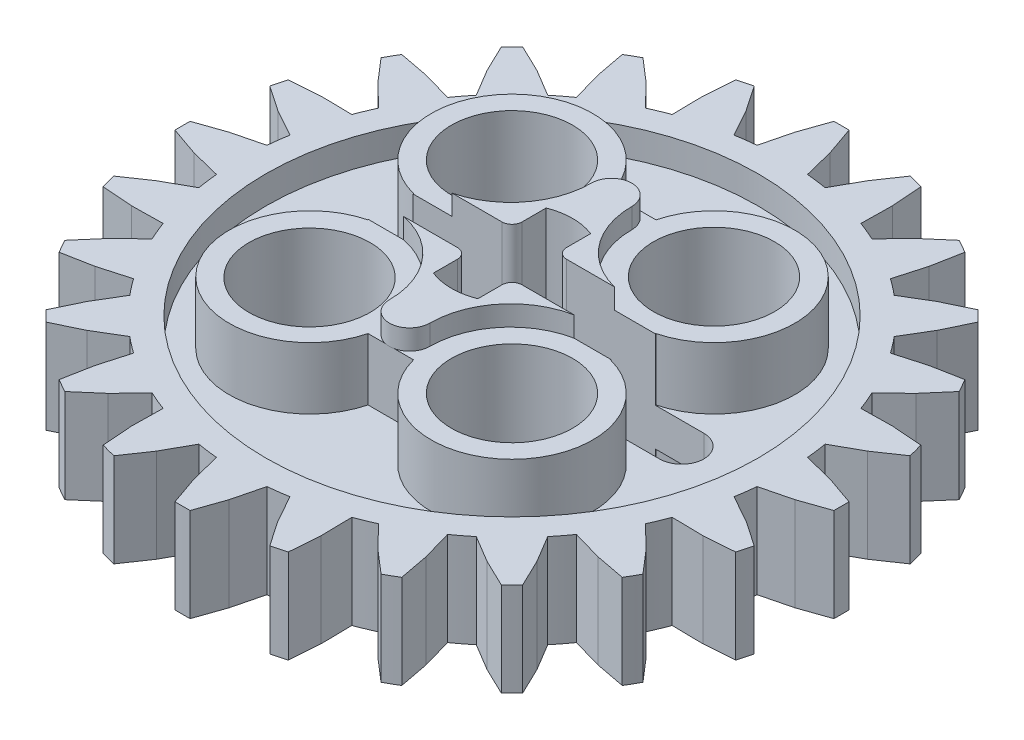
from build123d import *

# Parameters (mm, degrees)
EXTRUDE_1_DEPTH       = 3.71
SKETCH_2_R            = 9.75
CUT_EXTRUDE_1_DEPTH   = 1.105
EXTRUDE_2_DEPTH       = 2.45
CUT_EXTRUDE_START     = -1.105
SKETCH_4_R            = 9.75
CUT_EXTRUDE_2_DEPTH   = 1.105
EXTRUDE_START         = 2.45
EXTRUDE_3_DEPTH       = 2.45
EXTRUDE_4_DEPTH       = 0.8
EXTRUDE_START_2       = 0.8
EXTRUDE_5_DEPTH       = 0.8
EXTRUDE_6_DEPTH       = 2.45
EXTRUDE_7_DEPTH       = 2.45
EXTRUDE_8_DEPTH       = 0.8
EXTRUDE_9_DEPTH       = 0.8
CUT_EXTRUDE_3_DEPTH   = 21.11479555
CUT_EXTRUDE_4_DEPTH   = 21.11479555
HOLE_WIZARD_8_1_D     = 4.8
HOLE_WIZARD_8_1_DEPTH = 7.2
FILLET_1_R            = 0.4


with BuildPart() as part:
    # Sketch 1 → Extrude 1 (new body)
    with BuildSketch(Plane.XZ.offset(1.855)):
        with BuildLine():
            Line((6.783083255, -11.14864483), (6.556217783, -9.955702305))
            Line((6.556217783, -9.955702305), (6.217719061, -8.769405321))
            ThreePointArc((6.217719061, -8.769405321), (6.544185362, -8.528548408), (6.86133097, -8.275544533))
            Line((6.86133097, -8.275544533), (7.919595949, -8.909545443))
            Line((7.919595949, -8.909545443), (9.013172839, -9.437436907))
            ThreePointArc((9.013172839, -9.437436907), (9.227743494, -9.227743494), (9.437436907, -9.013172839))
            Line((9.437436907, -9.013172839), (8.909545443, -7.919595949))
            Line((8.909545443, -7.919595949), (8.275544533, -6.86133097))
            ThreePointArc((8.275544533, -6.86133097), (8.528548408, -6.544185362), (8.769405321, -6.217719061))
            Line((8.769405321, -6.217719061), (9.955702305, -6.556217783))
            Line((9.955702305, -6.556217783), (11.14864483, -6.783083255))
            ThreePointArc((11.14864483, -6.783083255), (11.301631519, -6.525), (11.44864483, -6.263468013))
            Line((11.44864483, -6.263468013), (10.655702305, -5.343782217))
            Line((10.655702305, -5.343782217), (9.769405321, -4.485668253))
            ThreePointArc((9.769405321, -4.485668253), (9.931704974, -4.113846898), (10.079859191, -3.73616631))
            Line((10.079859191, -3.73616631), (11.313344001, -3.756094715))
            Line((11.313344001, -3.756094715), (12.524355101, -3.666473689))
            ThreePointArc((12.524355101, -3.666473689), (12.605332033, -3.377588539), (12.679646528, -3.086918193))
            Line((12.679646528, -3.086918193), (11.675690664, -2.403798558))
            Line((11.675690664, -2.403798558), (10.597497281, -1.804314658))
            ThreePointArc((10.597497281, -1.804314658), (10.65803226, -1.403156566), (10.703387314, -1))
            Line((10.703387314, -1), (11.9, -0.7))
            Line((11.9, -0.7), (13.046551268, -0.3))
            ThreePointArc((13.046551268, -0.3), (13.05, 0), (13.046551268, 0.3))
            Line((13.046551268, 0.3), (11.9, 0.7))
            Line((11.9, 0.7), (10.703387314, 1))
            ThreePointArc((10.703387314, 1), (10.65803226, 1.403156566), (10.597497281, 1.804314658))
            Line((10.597497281, 1.804314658), (11.675690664, 2.403798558))
            Line((11.675690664, 2.403798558), (12.679646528, 3.086918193))
            ThreePointArc((12.679646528, 3.086918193), (12.605332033, 3.377588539), (12.524355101, 3.666473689))
            Line((12.524355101, 3.666473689), (11.313344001, 3.756094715))
            Line((11.313344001, 3.756094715), (10.079859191, 3.73616631))
            ThreePointArc((10.079859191, 3.73616631), (9.931704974, 4.113846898), (9.769405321, 4.485668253))
            Line((9.769405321, 4.485668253), (10.655702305, 5.343782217))
            Line((10.655702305, 5.343782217), (11.44864483, 6.263468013))
            ThreePointArc((11.44864483, 6.263468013), (11.301631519, 6.525), (11.14864483, 6.783083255))
            Line((11.14864483, 6.783083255), (9.955702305, 6.556217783))
            Line((9.955702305, 6.556217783), (8.769405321, 6.217719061))
            ThreePointArc((8.769405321, 6.217719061), (8.528548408, 6.544185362), (8.275544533, 6.86133097))
            Line((8.275544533, 6.86133097), (8.909545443, 7.919595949))
            Line((8.909545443, 7.919595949), (9.437436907, 9.013172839))
            ThreePointArc((9.437436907, 9.013172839), (9.227743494, 9.227743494), (9.013172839, 9.437436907))
            Line((9.013172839, 9.437436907), (7.919595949, 8.909545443))
            Line((7.919595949, 8.909545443), (6.86133097, 8.275544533))
            ThreePointArc((6.86133097, 8.275544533), (6.544185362, 8.528548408), (6.217719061, 8.769405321))
            Line((6.217719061, 8.769405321), (6.556217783, 9.955702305))
            Line((6.556217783, 9.955702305), (6.783083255, 11.14864483))
            ThreePointArc((6.783083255, 11.14864483), (6.525, 11.301631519), (6.263468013, 11.44864483))
            Line((6.263468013, 11.44864483), (5.343782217, 10.655702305))
            Line((5.343782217, 10.655702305), (4.485668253, 9.769405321))
            ThreePointArc((4.485668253, 9.769405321), (4.113846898, 9.931704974), (3.73616631, 10.079859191))
            Line((3.73616631, 10.079859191), (3.756094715, 11.313344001))
            Line((3.756094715, 11.313344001), (3.666473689, 12.524355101))
            ThreePointArc((3.666473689, 12.524355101), (3.377588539, 12.605332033), (3.086918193, 12.679646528))
            Line((3.086918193, 12.679646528), (2.403798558, 11.675690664))
            Line((2.403798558, 11.675690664), (1.804314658, 10.597497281))
            ThreePointArc((1.804314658, 10.597497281), (1.403156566, 10.65803226), (1, 10.703387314))
            Line((1, 10.703387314), (0.7, 11.9))
            Line((0.7, 11.9), (0.3, 13.046551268))
            ThreePointArc((0.3, 13.046551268), (0, 13.05), (-0.3, 13.046551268))
            Line((-0.3, 13.046551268), (-0.7, 11.9))
            Line((-0.7, 11.9), (-1, 10.703387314))
            ThreePointArc((-1, 10.703387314), (-1.403156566, 10.65803226), (-1.804314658, 10.597497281))
            Line((-1.804314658, 10.597497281), (-2.403798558, 11.675690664))
            Line((-2.403798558, 11.675690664), (-3.086918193, 12.679646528))
            ThreePointArc((-3.086918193, 12.679646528), (-3.377588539, 12.605332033), (-3.666473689, 12.524355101))
            Line((-3.666473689, 12.524355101), (-3.756094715, 11.313344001))
            Line((-3.756094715, 11.313344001), (-3.73616631, 10.079859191))
            ThreePointArc((-3.73616631, 10.079859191), (-4.113846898, 9.931704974), (-4.485668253, 9.769405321))
            Line((-4.485668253, 9.769405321), (-5.343782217, 10.655702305))
            Line((-5.343782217, 10.655702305), (-6.263468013, 11.44864483))
            ThreePointArc((-6.263468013, 11.44864483), (-6.525, 11.301631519), (-6.783083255, 11.14864483))
            Line((-6.783083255, 11.14864483), (-6.556217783, 9.955702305))
            Line((-6.556217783, 9.955702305), (-6.217719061, 8.769405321))
            ThreePointArc((-6.217719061, 8.769405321), (-6.544185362, 8.528548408), (-6.86133097, 8.275544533))
            Line((-6.86133097, 8.275544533), (-7.919595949, 8.909545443))
            Line((-7.919595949, 8.909545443), (-9.013172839, 9.437436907))
            ThreePointArc((-9.013172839, 9.437436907), (-9.227743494, 9.227743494), (-9.437436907, 9.013172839))
            Line((-9.437436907, 9.013172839), (-8.909545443, 7.919595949))
            Line((-8.909545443, 7.919595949), (-8.275544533, 6.86133097))
            ThreePointArc((-8.275544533, 6.86133097), (-8.528548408, 6.544185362), (-8.769405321, 6.217719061))
            Line((-8.769405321, 6.217719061), (-9.955702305, 6.556217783))
            Line((-9.955702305, 6.556217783), (-11.14864483, 6.783083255))
            ThreePointArc((-11.14864483, 6.783083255), (-11.301631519, 6.525), (-11.44864483, 6.263468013))
            Line((-11.44864483, 6.263468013), (-10.655702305, 5.343782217))
            Line((-10.655702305, 5.343782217), (-9.769405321, 4.485668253))
            ThreePointArc((-9.769405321, 4.485668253), (-9.931704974, 4.113846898), (-10.079859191, 3.73616631))
            Line((-10.079859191, 3.73616631), (-11.313344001, 3.756094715))
            Line((-11.313344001, 3.756094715), (-12.524355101, 3.666473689))
            ThreePointArc((-12.524355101, 3.666473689), (-12.605332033, 3.377588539), (-12.679646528, 3.086918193))
            Line((-12.679646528, 3.086918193), (-11.675690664, 2.403798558))
            Line((-11.675690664, 2.403798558), (-10.597497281, 1.804314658))
            ThreePointArc((-10.597497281, 1.804314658), (-10.65803226, 1.403156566), (-10.703387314, 1))
            Line((-10.703387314, 1), (-11.9, 0.7))
            Line((-11.9, 0.7), (-13.046551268, 0.3))
            ThreePointArc((-13.046551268, 0.3), (-13.05, 0), (-13.046551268, -0.3))
            Line((-13.046551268, -0.3), (-11.9, -0.7))
            Line((-11.9, -0.7), (-10.703387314, -1))
            ThreePointArc((-10.703387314, -1), (-10.65803226, -1.403156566), (-10.597497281, -1.804314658))
            Line((-10.597497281, -1.804314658), (-11.675690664, -2.403798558))
            Line((-11.675690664, -2.403798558), (-12.679646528, -3.086918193))
            ThreePointArc((-12.679646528, -3.086918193), (-12.605332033, -3.377588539), (-12.524355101, -3.666473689))
            Line((-12.524355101, -3.666473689), (-11.313344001, -3.756094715))
            Line((-11.313344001, -3.756094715), (-10.079859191, -3.73616631))
            ThreePointArc((-10.079859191, -3.73616631), (-9.931704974, -4.113846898), (-9.769405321, -4.485668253))
            Line((-9.769405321, -4.485668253), (-10.655702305, -5.343782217))
            Line((-10.655702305, -5.343782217), (-11.44864483, -6.263468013))
            ThreePointArc((-11.44864483, -6.263468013), (-11.301631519, -6.525), (-11.14864483, -6.783083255))
            Line((-11.14864483, -6.783083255), (-9.955702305, -6.556217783))
            Line((-9.955702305, -6.556217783), (-8.769405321, -6.217719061))
            ThreePointArc((-8.769405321, -6.217719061), (-8.528548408, -6.544185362), (-8.275544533, -6.86133097))
            Line((-8.275544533, -6.86133097), (-8.909545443, -7.919595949))
            Line((-8.909545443, -7.919595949), (-9.437436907, -9.013172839))
            ThreePointArc((-9.437436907, -9.013172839), (-9.227743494, -9.227743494), (-9.013172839, -9.437436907))
            Line((-9.013172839, -9.437436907), (-7.919595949, -8.909545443))
            Line((-7.919595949, -8.909545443), (-6.86133097, -8.275544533))
            ThreePointArc((-6.86133097, -8.275544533), (-6.544185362, -8.528548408), (-6.217719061, -8.769405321))
            Line((-6.217719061, -8.769405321), (-6.556217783, -9.955702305))
            Line((-6.556217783, -9.955702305), (-6.783083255, -11.14864483))
            ThreePointArc((-6.783083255, -11.14864483), (-6.525, -11.301631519), (-6.263468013, -11.44864483))
            Line((-6.263468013, -11.44864483), (-5.343782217, -10.655702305))
            Line((-5.343782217, -10.655702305), (-4.485668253, -9.769405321))
            ThreePointArc((-4.485668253, -9.769405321), (-4.113846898, -9.931704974), (-3.73616631, -10.079859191))
            Line((-3.73616631, -10.079859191), (-3.756094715, -11.313344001))
            Line((-3.756094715, -11.313344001), (-3.666473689, -12.524355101))
            ThreePointArc((-3.666473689, -12.524355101), (-3.377588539, -12.605332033), (-3.086918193, -12.679646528))
            Line((-3.086918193, -12.679646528), (-2.403798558, -11.675690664))
            Line((-2.403798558, -11.675690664), (-1.804314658, -10.597497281))
            ThreePointArc((-1.804314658, -10.597497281), (-1.403156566, -10.65803226), (-1, -10.703387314))
            Line((-1, -10.703387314), (-0.7, -11.9))
            Line((-0.7, -11.9), (-0.3, -13.046551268))
            ThreePointArc((-0.3, -13.046551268), (0, -13.05), (0.3, -13.046551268))
            Line((0.3, -13.046551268), (0.7, -11.9))
            Line((0.7, -11.9), (1, -10.703387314))
            ThreePointArc((1, -10.703387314), (1.403156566, -10.65803226), (1.804314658, -10.597497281))
            Line((1.804314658, -10.597497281), (2.403798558, -11.675690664))
            Line((2.403798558, -11.675690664), (3.086918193, -12.679646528))
            ThreePointArc((3.086918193, -12.679646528), (3.377588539, -12.605332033), (3.666473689, -12.524355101))
            Line((3.666473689, -12.524355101), (3.756094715, -11.313344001))
            Line((3.756094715, -11.313344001), (3.73616631, -10.079859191))
            ThreePointArc((3.73616631, -10.079859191), (4.113846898, -9.931704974), (4.485668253, -9.769405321))
            Line((4.485668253, -9.769405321), (5.343782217, -10.655702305))
            Line((5.343782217, -10.655702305), (6.263468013, -11.44864483))
            ThreePointArc((6.263468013, -11.44864483), (6.525, -11.301631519), (6.783083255, -11.14864483))
        make_face()
        with BuildLine():
            Line((6.72, -0.88), (-6.72, -0.88))
            ThreePointArc((-6.72, -0.88), (-7.6, 0), (-6.72, 0.88))
            Line((-6.72, 0.88), (6.72, 0.88))
            ThreePointArc((6.72, 0.88), (7.6, 0), (6.72, -0.88))
        make_face(mode=Mode.SUBTRACT)
    extrude(amount=-EXTRUDE_1_DEPTH)

    # Sketch 2 → Cut-Extrude 1 (cut)
    with BuildSketch(Plane.XZ.offset(1.855)):
        with Locations(Location((0, 0, 0), (0, 0, 90))):
            Circle(SKETCH_2_R)
        with BuildLine():
            Line((6.72, -0.88), (-6.72, -0.88))
            ThreePointArc((-6.72, -0.88), (-7.6, 0), (-6.72, 0.88))
            Line((-6.72, 0.88), (6.72, 0.88))
            ThreePointArc((6.72, 0.88), (7.6, 0), (6.72, -0.88))
        make_face(mode=Mode.SUBTRACT)
    extrude(amount=-CUT_EXTRUDE_1_DEPTH, mode=Mode.SUBTRACT)

    # Sketch 3 → Extrude 2 (add)
    with BuildSketch(Plane.XZ.offset(0.75)):
        with BuildLine():
            Line((4.8, 0.88), (-4.8, 0.88))
            Line((-4.8, 0.88), (-4.8, 0.901613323))
            ThreePointArc((-4.8, 0.901613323), (-6.2627417, 6.2627417), (-0.901613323, 4.8))
            Line((-0.901613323, 4.8), (0.901613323, 4.8))
            ThreePointArc((0.901613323, 4.8), (6.2627417, 6.2627417), (4.8, 0.901613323))
            Line((4.8, 0.901613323), (4.8, 0.88))
        make_face()
    extrude(amount=EXTRUDE_2_DEPTH)

    # Sketch 4 → Cut-Extrude 2 (cut)
    with BuildSketch(Plane(origin=(0, 1.855, 0), x_dir=(-1, 0, 0), z_dir=(0, 1, 0)).offset(CUT_EXTRUDE_START)):
        with Locations(Location((0, 0, 0), (0, 0, 90))):
            Circle(SKETCH_4_R)
        with BuildLine():
            Line((6.72, -0.88), (-6.72, -0.88))
            ThreePointArc((-6.72, -0.88), (-7.6, 0), (-6.72, 0.88))
            Line((-6.72, 0.88), (6.72, 0.88))
            ThreePointArc((6.72, 0.88), (7.6, 0), (6.72, -0.88))
        make_face(mode=Mode.SUBTRACT)
    extrude(amount=CUT_EXTRUDE_2_DEPTH, mode=Mode.SUBTRACT)

    # Sketch 5 → Extrude 3 (add)
    with BuildSketch(Plane(origin=(0, 0.75, 0), x_dir=(-1, 0, 0), z_dir=(0, 1, 0)).offset(EXTRUDE_START)):
        with BuildLine():
            Line((-0.901613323, 4.8), (0.901613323, 4.8))
            ThreePointArc((0.901613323, 4.8), (6.2627417, 6.2627417), (4.8, 0.901613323))
            Line((4.8, 0.901613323), (4.8, 0.88))
            Line((4.8, 0.88), (-4.8, 0.88))
            Line((-4.8, 0.88), (-4.8, 0.901613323))
            ThreePointArc((-4.8, 0.901613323), (-6.2627417, 6.2627417), (-0.901613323, 4.8))
        make_face()
    extrude(amount=-EXTRUDE_3_DEPTH)

    # Sketch 6 → Extrude 4 (add)
    with BuildSketch(Plane.XZ.offset(3.2)):
        with BuildLine():
            Line((3.338733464, 0.88), (-3.412848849, 0.88))
            ThreePointArc((-3.412848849, 0.88), (-1.563450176, 1.988438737), (-0.837057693, 4.018528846))
            ThreePointArc((-0.837057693, 4.018528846), (-0.037057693, 4.818528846), (0.762942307, 4.018528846))
            ThreePointArc((0.762942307, 4.018528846), (1.48933479, 1.988438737), (3.338733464, 0.88))
        make_face()
    extrude(amount=EXTRUDE_4_DEPTH)

    # Sketch 7 → Extrude 5 (add)
    with BuildSketch(Plane(origin=(0, 3.2, 0), x_dir=(-1, 0, 0), z_dir=(0, 1, 0)).offset(EXTRUDE_START_2)):
        with BuildLine():
            Line((3.412848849, 0.88), (-3.338733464, 0.88))
            ThreePointArc((-3.338733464, 0.88), (-1.48933479, 1.988438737), (-0.762942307, 4.018528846))
            ThreePointArc((-0.762942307, 4.018528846), (0.037057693, 4.818528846), (0.837057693, 4.018528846))
            ThreePointArc((0.837057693, 4.018528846), (1.563450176, 1.988438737), (3.412848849, 0.88))
        make_face()
    extrude(amount=-EXTRUDE_5_DEPTH)

    # Sketch 8 → Extrude 6 (add)
    with BuildSketch(Plane.XZ.offset(0.75)):
        with BuildLine():
            Line((-4.8, -0.88), (4.8, -0.88))
            Line((4.8, -0.88), (4.8, -0.901613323))
            ThreePointArc((4.8, -0.901613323), (6.2627417, -6.2627417), (0.901613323, -4.8))
            Line((0.901613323, -4.8), (-0.901613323, -4.8))
            ThreePointArc((-0.901613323, -4.8), (-6.2627417, -6.2627417), (-4.8, -0.901613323))
            Line((-4.8, -0.901613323), (-4.8, -0.88))
        make_face()
    extrude(amount=EXTRUDE_6_DEPTH)

    # Sketch 9 → Extrude 7 (add)
    with BuildSketch(Plane(origin=(0, 0.75, 0), x_dir=(-1, 0, 0), z_dir=(0, 1, 0)).offset(EXTRUDE_START)):
        with BuildLine():
            Line((-4.8, -0.88), (4.8, -0.88))
            Line((4.8, -0.88), (4.8, -0.901613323))
            ThreePointArc((4.8, -0.901613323), (6.2627417, -6.2627417), (0.901613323, -4.8))
            Line((0.901613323, -4.8), (-0.901613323, -4.8))
            ThreePointArc((-0.901613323, -4.8), (-6.2627417, -6.2627417), (-4.8, -0.901613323))
            Line((-4.8, -0.901613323), (-4.8, -0.88))
        make_face()
    extrude(amount=-EXTRUDE_7_DEPTH)

    # Sketch 10 → Extrude 8 (add)
    with BuildSketch(Plane(origin=(0, 3.2, 0), x_dir=(-1, 0, 0), z_dir=(0, 1, 0))):
        with BuildLine():
            Line((-3.174985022, -0.88), (3.249100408, -0.88))
            ThreePointArc((3.249100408, -0.88), (1.511046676, -2.016969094), (0.837057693, -3.981471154))
            ThreePointArc((0.837057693, -3.981471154), (0.037057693, -4.781471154), (-0.762942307, -3.981471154))
            ThreePointArc((-0.762942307, -3.981471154), (-1.43693129, -2.016969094), (-3.174985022, -0.88))
        make_face()
    extrude(amount=EXTRUDE_8_DEPTH)

    # Sketch 11 → Extrude 9 (add)
    with BuildSketch(Plane.XZ.offset(3.2).offset(EXTRUDE_START_2)):
        with BuildLine():
            Line((-3.249100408, -0.88), (3.174985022, -0.88))
            ThreePointArc((3.174985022, -0.88), (1.43693129, -2.016969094), (0.762942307, -3.981471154))
            ThreePointArc((0.762942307, -3.981471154), (-0.037057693, -4.781471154), (-0.837057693, -3.981471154))
            ThreePointArc((-0.837057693, -3.981471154), (-1.511046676, -2.016969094), (-3.249100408, -0.88))
        make_face()
    extrude(amount=-EXTRUDE_9_DEPTH)

    # Sketch 12 → Cut-Extrude 3 (cut, through all)
    with BuildSketch(Plane(origin=(0, 4, 0), x_dir=(-1, 0, 0), z_dir=(0, 1, 0))):
        with BuildLine():
            Line((-0.88, 0.88), (0.88, 0.88))
            Line((0.88, 0.88), (0.88, 2.232845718))
            ThreePointArc((0.88, 2.232845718), (0, 2.4), (-0.88, 2.232845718))
            Line((-0.88, 2.232845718), (-0.88, 0.88))
        make_face()
    extrude(amount=-CUT_EXTRUDE_3_DEPTH, mode=Mode.SUBTRACT)

    # Sketch 13 → Cut-Extrude 4 (cut, through all)
    with BuildSketch(Plane.XZ.offset(4)):
        with BuildLine():
            Line((0.88, -0.88), (-0.88, -0.88))
            Line((-0.88, -0.88), (-0.88, -2.232845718))
            ThreePointArc((-0.88, -2.232845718), (0, -2.4), (0.88, -2.232845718))
            Line((0.88, -2.232845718), (0.88, -0.88))
        make_face()
    extrude(amount=-CUT_EXTRUDE_4_DEPTH, mode=Mode.SUBTRACT)

    # Hole Wizard 8 _ _1
    with Locations(Plane(origin=(0, -3.2, 0), x_dir=(-1, 0, 0), z_dir=(0, -1, 0))):
        with Locations((-4, -4), (3.981471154, -4.037057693), (-4, 4), (4, 4)):
            Hole(HOLE_WIZARD_8_1_D / 2, depth=HOLE_WIZARD_8_1_DEPTH)

    # Fillet 1
    fillet_1_edges = [part.edges().sort_by_distance(p)[0] for p in [
        (0.88, 0, 0.88),
        (-0.88, 0, 0.88),
        (0.88, 0, -0.88),
        (-0.88, 0, -0.88),
    ]]
    fillet(fillet_1_edges, radius=FILLET_1_R)


solid = part.part
